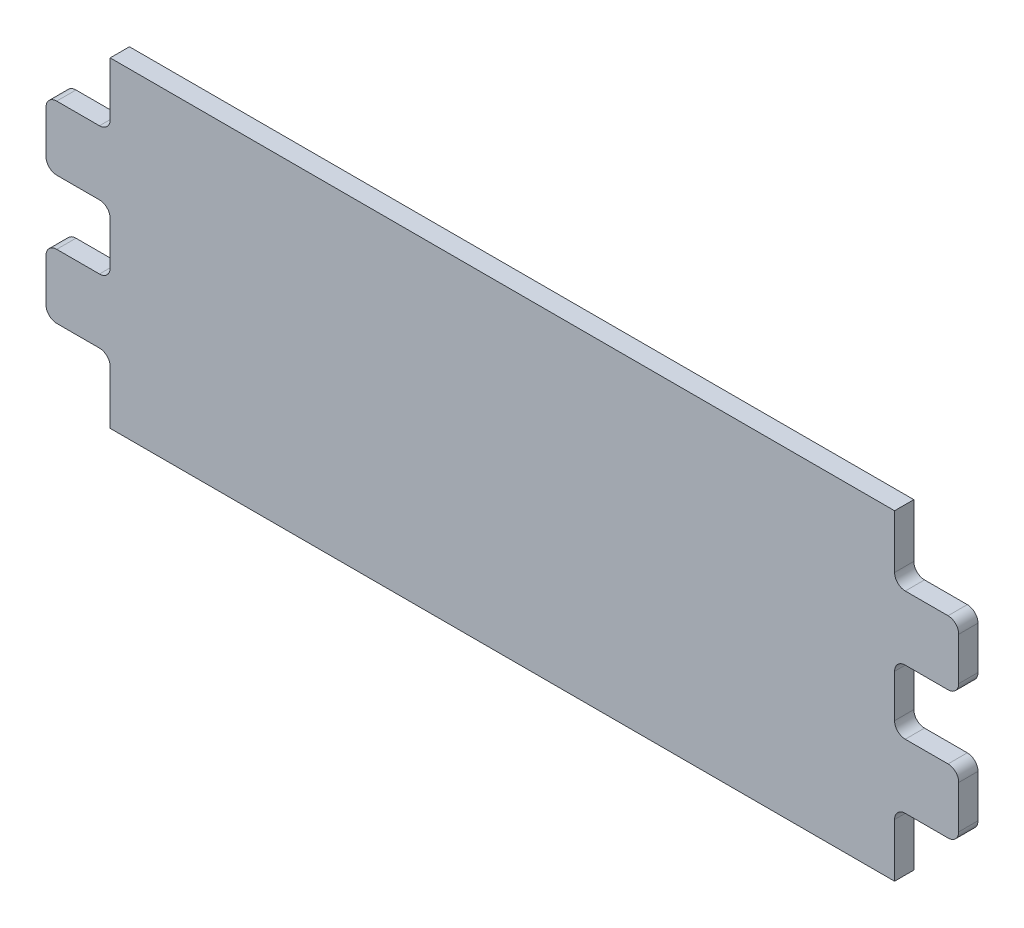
from build123d import *

# Parameters (mm, degrees)
BOSS_EXTRU_1_DEPTH              = 18
ENL_V_MAT_EXTRU_1_DEPTH         = 1129.195018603
ENL_V_MAT_EXTRU_1_DEPTH_BACK    = 18
ENL_V_MAT_EXTRU_2_DEPTH         = 30
CONG_2_R                        = 10
CONG_3_R                        = 10
ENL_V_MAT_EXTRU_3_DEPTH         = 9
R_P_TITION_LIN_AIRE2_COUNT      = 2
R_P_TITION_LIN_AIRE2_PITCH      = 793.33
R_P_TITION_LIN_AIRE2_COUNT_DIR2 = 2
R_P_TITION_LIN_AIRE2_PITCH_DIR2 = 120


with BuildPart() as part:
    # Esquisse1 → Boss.-Extru.1 (new body)
    with BuildSketch(Plane.XY):
        with BuildLine():
            Line((-850, -250), (850, -250))
            ThreePointArc((850, -250), (1100, 0), (850, 250))
            Line((850, 250), (-850, 250))
            ThreePointArc((-850, 250), (-1100, 0), (-850, -250))
        make_face()
    extrude(amount=BOSS_EXTRU_1_DEPTH)

    # Esquisse2 → Enl_v. mat.-Extru.1 (cut, two sides: drawn at the far end of the back side and taken through both)
    with BuildSketch(Plane.XY.offset(18).offset(-ENL_V_MAT_EXTRU_1_DEPTH_BACK)):
        Polygon((-750, 4092.753579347), (-750, 250), (-750, 50), (750, 50), (750, 250), (750, 4092.753579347), (750, 11778.260738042), (-750, 11778.260738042), align=None)
    extrude(amount=ENL_V_MAT_EXTRU_1_DEPTH + ENL_V_MAT_EXTRU_1_DEPTH_BACK, mode=Mode.SUBTRACT)

    # Esquisse5 → Enl_v. mat.-Extru.2 (cut)
    with BuildSketch(Plane(origin=(0, 0, 0), x_dir=(-1, 0, 0), z_dir=(0, 0, -1))):
        with BuildLine():
            Line((750, 50), (366.666666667, 50))
            Line((366.666666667, 50), (366.666666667, -10))
            Line((366.666666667, -10), (426.666666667, -10))
            Line((426.666666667, -10), (426.666666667, -70))
            Line((426.666666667, -70), (366.666666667, -70))
            Line((366.666666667, -70), (366.666666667, -130))
            Line((366.666666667, -130), (426.666666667, -130))
            Line((426.666666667, -130), (426.666666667, -190))
            Line((426.666666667, -190), (366.666666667, -190))
            Line((366.666666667, -190), (366.666666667, -250))
            Line((366.666666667, -250), (850, -250))
            ThreePointArc((850, -250), (1100, 0), (850, 250))
            Line((850, 250), (750, 250))
            Line((750, 250), (750, 50))
        make_face()
        with BuildLine():
            Line((-850, -250), (-366.666666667, -250))
            Line((-366.666666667, -250), (-366.666666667, -190))
            Line((-366.666666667, -190), (-426.666666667, -190))
            Line((-426.666666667, -190), (-426.666666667, -130))
            Line((-426.666666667, -130), (-366.666666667, -130))
            Line((-366.666666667, -130), (-366.666666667, -70))
            Line((-366.666666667, -70), (-426.666666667, -70))
            Line((-426.666666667, -70), (-426.666666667, -10))
            Line((-426.666666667, -10), (-366.666666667, -10))
            Line((-366.666666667, -10), (-366.666666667, 50))
            Line((-366.666666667, 50), (-750, 50))
            Line((-750, 50), (-750, 250))
            Line((-750, 250), (-850, 250))
            ThreePointArc((-850, 250), (-1100, 0), (-850, -250))
        make_face()
    extrude(amount=-ENL_V_MAT_EXTRU_2_DEPTH, mode=Mode.SUBTRACT)

    # Cong_2
    cong_2_edges = [part.edges().sort_by_distance(p)[0] for p in [
        (426.666666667, -10, 9),
        (426.666666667, -70, 9),
        (426.666666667, -130, 9),
        (426.666666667, -190, 9),
    ]]
    fillet(cong_2_edges, radius=CONG_2_R)

    # Cong_3
    cong_3_edges = [part.edges().sort_by_distance(p)[0] for p in [
        (-366.666666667, -190, 9),
        (-426.666666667, -190, 9),
        (-426.666666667, -130, 9),
        (-366.666666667, -130, 9),
        (-366.666666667, -70, 9),
        (-426.666666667, -70, 9),
        (-426.666666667, -10, 9),
        (-366.666666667, -10, 9),
        (366.666666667, -10, 9),
        (366.666666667, -70, 9),
        (366.666666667, -130, 9),
        (366.666666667, -190, 9),
    ]]
    fillet(cong_3_edges, radius=CONG_3_R)

    # Esquisse6 → Enl_v. mat.-Extru.3 (cut)
    with BuildSketch(Plane(origin=(0, 0, 0), x_dir=(-1, 0, 0), z_dir=(0, 0, -1))):
        with BuildLine():
            Line((-401.42402598, -54), (-391.909307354, -54))
            ThreePointArc((-391.909307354, -54), (-387.666666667, -54), (-387.666666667, -49.757359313))
            Line((-387.666666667, -49.757359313), (-387.666666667, -30.242640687))
            ThreePointArc((-387.666666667, -30.242640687), (-387.666666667, -26), (-391.909307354, -26))
            Line((-391.909307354, -26), (-401.42402598, -26))
            ThreePointArc((-401.42402598, -26), (-405.666666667, -26), (-405.666666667, -30.242640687))
            Line((-405.666666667, -30.242640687), (-405.666666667, -49.757359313))
            ThreePointArc((-405.666666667, -49.757359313), (-405.666666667, -54), (-401.42402598, -54))
        make_face()
    enl_v_mat_extru_3 = extrude(amount=-ENL_V_MAT_EXTRU_3_DEPTH, mode=Mode.SUBTRACT)

    # R_p_tition lin_aire2: Enl_v. mat.-Extru.3 2 × 2
    with Locations(*[(-i * R_P_TITION_LIN_AIRE2_PITCH, -j * R_P_TITION_LIN_AIRE2_PITCH_DIR2, 0) for i in range(R_P_TITION_LIN_AIRE2_COUNT) for j in range(R_P_TITION_LIN_AIRE2_COUNT_DIR2) if (i, j) != (0, 0)]):
        add(enl_v_mat_extru_3, mode=Mode.SUBTRACT)


solid = part.part
